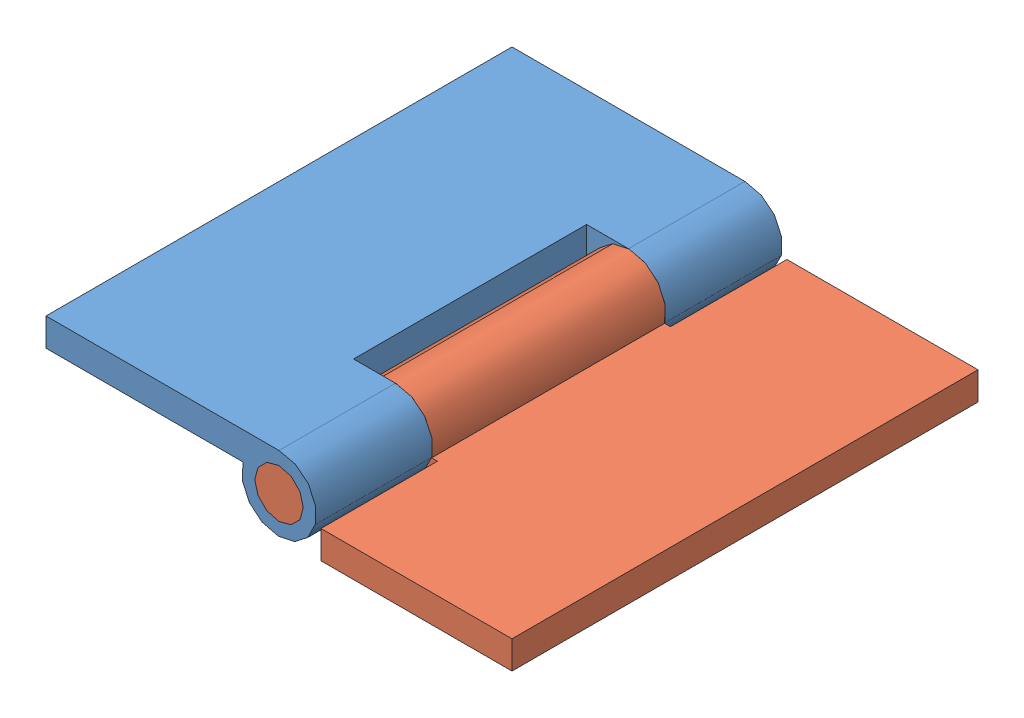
SolidWorks assembly 72-1-3638_Temp.SLDASM, configuration Default (file format 4100). Lengths in mm.
Overall size (50 8 50).
2 component instances, 2 part files, 0 mates.
Components (placement in the parent):
- 72-1-3638_01-1: 72-1-3638_01.SLDPRT [Default] at origin size (29 8 50)
- 72-1-3638_02-1: 72-1-3638_02.SLDPRT [Default] at origin size (29 8 50)
